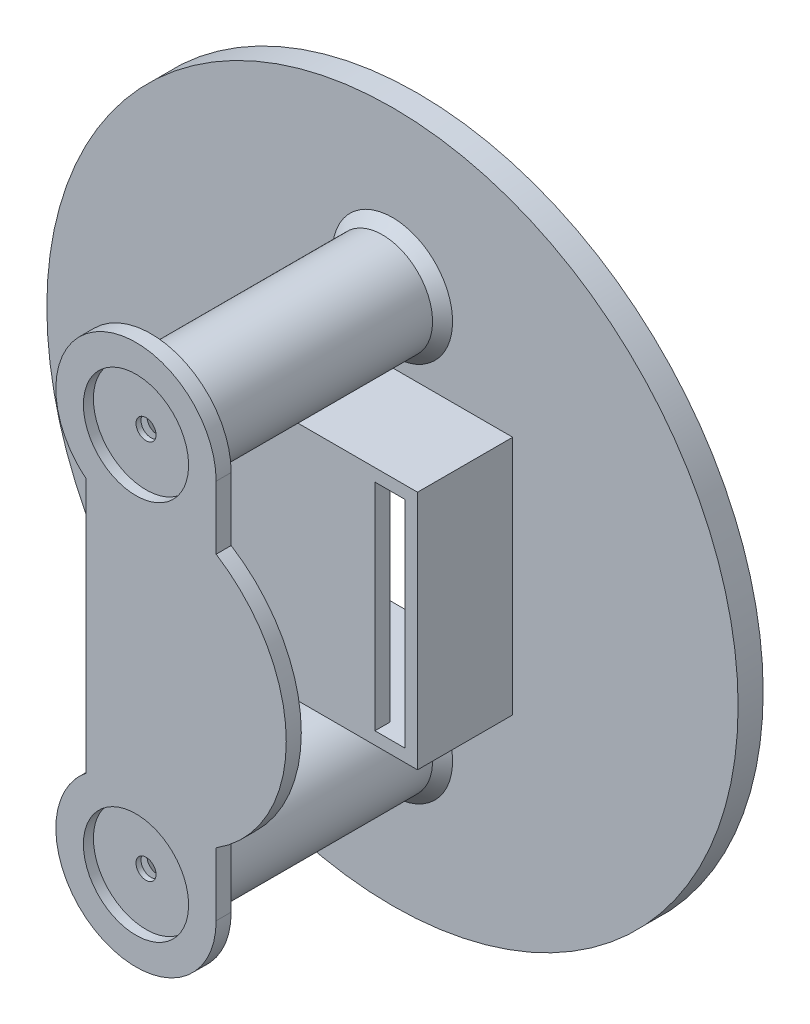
ISO-10303-21;
HEADER;
FILE_DESCRIPTION(('STEP AP214'),'2;1');
FILE_NAME('part.step','',(''),(''),'','','');
FILE_SCHEMA(('AUTOMOTIVE_DESIGN { 1 0 10303 214 1 1 1 1 }'));
ENDSEC;
DATA;
#1=APPLICATION_CONTEXT('core data for automotive mechanical design processes');
#2=APPLICATION_PROTOCOL_DEFINITION('international standard','automotive_design',2000,#1);
#3=PRODUCT_CONTEXT('',#1,'mechanical');
#4=PRODUCT('Part','Part','',(#3));
#5=PRODUCT_RELATED_PRODUCT_CATEGORY('part','',(#4));
#6=PRODUCT_DEFINITION_FORMATION('','',#4);
#7=PRODUCT_DEFINITION_CONTEXT('part definition',#1,'design');
#8=PRODUCT_DEFINITION('design','',#6,#7);
#9=PRODUCT_DEFINITION_SHAPE('','',#8);
#10=(LENGTH_UNIT() NAMED_UNIT(*) SI_UNIT(.MILLI.,.METRE.));
#11=(NAMED_UNIT(*) PLANE_ANGLE_UNIT() SI_UNIT($,.RADIAN.));
#12=(NAMED_UNIT(*) SI_UNIT($,.STERADIAN.) SOLID_ANGLE_UNIT());
#13=UNCERTAINTY_MEASURE_WITH_UNIT(LENGTH_MEASURE(1.E-05),#10,'distance_accuracy_value','');
#14=(GEOMETRIC_REPRESENTATION_CONTEXT(3) GLOBAL_UNCERTAINTY_ASSIGNED_CONTEXT((#13)) GLOBAL_UNIT_ASSIGNED_CONTEXT((#10,
#11,#12)) REPRESENTATION_CONTEXT('',''));
#15=CARTESIAN_POINT('',(0.,0.,0.));
#16=DIRECTION('',(0.,0.,1.));
#17=DIRECTION('',(1.,0.,0.));
#18=AXIS2_PLACEMENT_3D('',#15,#16,#17);
#19=CARTESIAN_POINT('',(0.,0.,0.));
#20=DIRECTION('',(0.,0.,1.));
#21=DIRECTION('',(1.,0.,0.));
#22=AXIS2_PLACEMENT_3D('',#19,#20,#21);
#23=CYLINDRICAL_SURFACE('',#22,34.5);
#24=CARTESIAN_POINT('',(0.,0.,2.5));
#25=DIRECTION('',(0.,0.,1.));
#26=DIRECTION('',(1.,0.,0.));
#27=AXIS2_PLACEMENT_3D('',#24,#25,#26);
#28=CIRCLE('',#27,34.5);
#29=CARTESIAN_POINT('',(-34.5,0.,2.5));
#30=VERTEX_POINT('',#29);
#31=EDGE_CURVE('P0_E218',#30,#30,#28,.T.);
#32=ORIENTED_EDGE('',*,*,#31,.F.);
#33=DIRECTION('',(0.,0.,-1.));
#34=VECTOR('',#33,1.);
#35=CARTESIAN_POINT('',(-34.5,0.,0.));
#36=LINE('',#35,#34);
#37=CARTESIAN_POINT('',(-34.5,0.,0.));
#38=VERTEX_POINT('',#37);
#39=EDGE_CURVE('P0_E11',#30,#38,#36,.T.);
#40=ORIENTED_EDGE('',*,*,#39,.T.);
#41=CARTESIAN_POINT('',(0.,0.,0.));
#42=DIRECTION('',(0.,0.,1.));
#43=DIRECTION('',(1.,0.,0.));
#44=AXIS2_PLACEMENT_3D('',#41,#42,#43);
#45=CIRCLE('',#44,34.5);
#46=EDGE_CURVE('P0_E284',#38,#38,#45,.T.);
#47=ORIENTED_EDGE('',*,*,#46,.T.);
#48=ORIENTED_EDGE('',*,*,#39,.F.);
#49=EDGE_LOOP('',(#32,#40,#47,#48));
#50=FACE_BOUND('',#49,.T.);
#51=ADVANCED_FACE('P0_F17',(#50),#23,.T.);
#52=CARTESIAN_POINT('',(0.,-19.,0.));
#53=DIRECTION('',(0.,0.,1.));
#54=DIRECTION('',(1.,0.,0.));
#55=AXIS2_PLACEMENT_3D('',#52,#53,#54);
#56=CYLINDRICAL_SURFACE('',#55,2.75);
#57=CARTESIAN_POINT('',(0.,-19.,24.5));
#58=DIRECTION('',(0.,0.,1.));
#59=DIRECTION('',(1.,0.,0.));
#60=AXIS2_PLACEMENT_3D('',#57,#58,#59);
#61=CIRCLE('',#60,2.75);
#62=CARTESIAN_POINT('',(-2.75,-19.,24.5));
#63=VERTEX_POINT('',#62);
#64=EDGE_CURVE('P0_E199',#63,#63,#61,.T.);
#65=ORIENTED_EDGE('',*,*,#64,.T.);
#66=DIRECTION('',(0.,0.,-1.));
#67=VECTOR('',#66,1.);
#68=CARTESIAN_POINT('',(-2.75,-19.,0.));
#69=LINE('',#68,#67);
#70=CARTESIAN_POINT('',(-2.75,-19.,0.));
#71=VERTEX_POINT('',#70);
#72=EDGE_CURVE('P0_E28',#63,#71,#69,.T.);
#73=ORIENTED_EDGE('',*,*,#72,.T.);
#74=CARTESIAN_POINT('',(0.,-19.,0.));
#75=DIRECTION('',(0.,0.,-1.));
#76=DIRECTION('',(1.,0.,0.));
#77=AXIS2_PLACEMENT_3D('',#74,#75,#76);
#78=CIRCLE('',#77,2.75);
#79=EDGE_CURVE('P0_E201',#71,#71,#78,.T.);
#80=ORIENTED_EDGE('',*,*,#79,.T.);
#81=ORIENTED_EDGE('',*,*,#72,.F.);
#82=EDGE_LOOP('',(#65,#73,#80,#81));
#83=FACE_BOUND('',#82,.T.);
#84=ADVANCED_FACE('P0_F197',(#83),#56,.F.);
#85=CARTESIAN_POINT('',(0.,19.0000002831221,0.));
#86=DIRECTION('',(0.,0.,1.));
#87=DIRECTION('',(1.,0.,0.));
#88=AXIS2_PLACEMENT_3D('',#85,#86,#87);
#89=CYLINDRICAL_SURFACE('',#88,2.75);
#90=CARTESIAN_POINT('',(0.,19.0000002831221,24.5));
#91=DIRECTION('',(0.,0.,1.));
#92=DIRECTION('',(1.,0.,0.));
#93=AXIS2_PLACEMENT_3D('',#90,#91,#92);
#94=CIRCLE('',#93,2.75);
#95=CARTESIAN_POINT('',(-2.75,19.0000002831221,24.5));
#96=VERTEX_POINT('',#95);
#97=EDGE_CURVE('P0_E240',#96,#96,#94,.T.);
#98=ORIENTED_EDGE('',*,*,#97,.T.);
#99=DIRECTION('',(0.,0.,-1.));
#100=VECTOR('',#99,1.);
#101=CARTESIAN_POINT('',(-2.75,19.0000002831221,0.));
#102=LINE('',#101,#100);
#103=CARTESIAN_POINT('',(-2.75,19.0000002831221,0.));
#104=VERTEX_POINT('',#103);
#105=EDGE_CURVE('P0_E144',#96,#104,#102,.T.);
#106=ORIENTED_EDGE('',*,*,#105,.T.);
#107=CARTESIAN_POINT('',(0.,19.0000002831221,0.));
#108=DIRECTION('',(0.,0.,-1.));
#109=DIRECTION('',(1.,0.,0.));
#110=AXIS2_PLACEMENT_3D('',#107,#108,#109);
#111=CIRCLE('',#110,2.75);
#112=EDGE_CURVE('P0_E21',#104,#104,#111,.T.);
#113=ORIENTED_EDGE('',*,*,#112,.T.);
#114=ORIENTED_EDGE('',*,*,#105,.F.);
#115=EDGE_LOOP('',(#98,#106,#113,#114));
#116=FACE_BOUND('',#115,.T.);
#117=ADVANCED_FACE('P0_F614',(#116),#89,.F.);
#118=CARTESIAN_POINT('',(0.,0.,12.));
#119=DIRECTION('',(0.,0.,1.));
#120=DIRECTION('',(1.,0.,0.));
#121=AXIS2_PLACEMENT_3D('',#118,#119,#120);
#122=PLANE('',#121);
#123=CARTESIAN_POINT('',(-8.1,8.1,12.));
#124=DIRECTION('',(0.,0.,-1.));
#125=DIRECTION('',(1.,0.,0.));
#126=AXIS2_PLACEMENT_3D('',#123,#124,#125);
#127=CIRCLE('',#126,1.65);
#128=CARTESIAN_POINT('',(-9.75,8.1,12.));
#129=VERTEX_POINT('',#128);
#130=EDGE_CURVE('P0_E317',#129,#129,#127,.T.);
#131=ORIENTED_EDGE('',*,*,#130,.T.);
#132=EDGE_LOOP('',(#131));
#133=FACE_BOUND('',#132,.T.);
#134=DIRECTION('',(0.,1.,0.));
#135=VECTOR('',#134,1.);
#136=CARTESIAN_POINT('',(7.75,10.75,12.));
#137=LINE('',#136,#135);
#138=CARTESIAN_POINT('',(7.75,-10.75,12.));
#139=VERTEX_POINT('',#138);
#140=CARTESIAN_POINT('',(7.75,10.75,12.));
#141=VERTEX_POINT('',#140);
#142=EDGE_CURVE('P0_E274',#139,#141,#137,.T.);
#143=ORIENTED_EDGE('',*,*,#142,.T.);
#144=DIRECTION('',(1.,0.,0.));
#145=VECTOR('',#144,1.);
#146=CARTESIAN_POINT('',(10.75,10.75,12.));
#147=LINE('',#146,#145);
#148=CARTESIAN_POINT('',(10.75,10.75,12.));
#149=VERTEX_POINT('',#148);
#150=EDGE_CURVE('P0_E275',#141,#149,#147,.T.);
#151=ORIENTED_EDGE('',*,*,#150,.T.);
#152=DIRECTION('',(0.,-1.,0.));
#153=VECTOR('',#152,1.);
#154=CARTESIAN_POINT('',(10.75,-10.75,12.));
#155=LINE('',#154,#153);
#156=CARTESIAN_POINT('',(10.75,-10.75,12.));
#157=VERTEX_POINT('',#156);
#158=EDGE_CURVE('P0_E331',#149,#157,#155,.T.);
#159=ORIENTED_EDGE('',*,*,#158,.T.);
#160=DIRECTION('',(-1.,0.,0.));
#161=VECTOR('',#160,1.);
#162=CARTESIAN_POINT('',(-10.75,-10.75,12.));
#163=LINE('',#162,#161);
#164=EDGE_CURVE('P0_E320',#157,#139,#163,.T.);
#165=ORIENTED_EDGE('',*,*,#164,.T.);
#166=EDGE_LOOP('',(#143,#151,#159,#165));
#167=FACE_BOUND('',#166,.T.);
#168=DIRECTION('',(0.,1.,0.));
#169=VECTOR('',#168,1.);
#170=CARTESIAN_POINT('',(12.0000001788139,-12.0000001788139,12.));
#171=LINE('',#170,#169);
#172=CARTESIAN_POINT('',(12.0000001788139,-12.0000001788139,12.));
#173=VERTEX_POINT('',#172);
#174=CARTESIAN_POINT('',(12.0000001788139,12.0000001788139,12.));
#175=VERTEX_POINT('',#174);
#176=EDGE_CURVE('P0_E315',#173,#175,#171,.T.);
#177=ORIENTED_EDGE('',*,*,#176,.T.);
#178=DIRECTION('',(-1.,0.,0.));
#179=VECTOR('',#178,1.);
#180=CARTESIAN_POINT('',(12.0000001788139,12.0000001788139,12.));
#181=LINE('',#180,#179);
#182=CARTESIAN_POINT('',(-12.0000001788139,12.0000001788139,12.));
#183=VERTEX_POINT('',#182);
#184=EDGE_CURVE('P0_E42',#175,#183,#181,.T.);
#185=ORIENTED_EDGE('',*,*,#184,.T.);
#186=DIRECTION('',(0.,-1.,0.));
#187=VECTOR('',#186,1.);
#188=CARTESIAN_POINT('',(-12.0000001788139,12.0000001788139,12.));
#189=LINE('',#188,#187);
#190=CARTESIAN_POINT('',(-12.0000001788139,-12.0000001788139,12.));
#191=VERTEX_POINT('',#190);
#192=EDGE_CURVE('P0_E279',#183,#191,#189,.T.);
#193=ORIENTED_EDGE('',*,*,#192,.T.);
#194=DIRECTION('',(1.,0.,0.));
#195=VECTOR('',#194,1.);
#196=CARTESIAN_POINT('',(-12.0000001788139,-12.0000001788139,12.));
#197=LINE('',#196,#195);
#198=EDGE_CURVE('P0_E290',#191,#173,#197,.T.);
#199=ORIENTED_EDGE('',*,*,#198,.T.);
#200=EDGE_LOOP('',(#177,#185,#193,#199));
#201=FACE_BOUND('',#200,.T.);
#202=ADVANCED_FACE('P0_F387',(#133,#167,#201),#122,.T.);
#203=CARTESIAN_POINT('',(12.0000001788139,12.0000001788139,0.));
#204=DIRECTION('',(0.,1.,0.));
#205=DIRECTION('',(1.,0.,0.));
#206=AXIS2_PLACEMENT_3D('',#203,#204,#205);
#207=PLANE('',#206);
#208=DIRECTION('',(1.,0.,0.));
#209=VECTOR('',#208,1.);
#210=CARTESIAN_POINT('',(12.0000001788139,12.0000001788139,2.5));
#211=LINE('',#210,#209);
#212=CARTESIAN_POINT('',(-12.0000001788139,12.0000001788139,2.5));
#213=VERTEX_POINT('',#212);
#214=CARTESIAN_POINT('',(12.0000001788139,12.0000001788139,2.5));
#215=VERTEX_POINT('',#214);
#216=EDGE_CURVE('P0_E295',#213,#215,#211,.T.);
#217=ORIENTED_EDGE('',*,*,#216,.F.);
#218=DIRECTION('',(0.,0.,1.));
#219=VECTOR('',#218,1.);
#220=CARTESIAN_POINT('',(-12.0000001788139,12.0000001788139,0.));
#221=LINE('',#220,#219);
#222=EDGE_CURVE('P0_E276',#213,#183,#221,.T.);
#223=ORIENTED_EDGE('',*,*,#222,.T.);
#224=ORIENTED_EDGE('',*,*,#184,.F.);
#225=DIRECTION('',(0.,0.,1.));
#226=VECTOR('',#225,1.);
#227=CARTESIAN_POINT('',(12.0000001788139,12.0000001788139,0.));
#228=LINE('',#227,#226);
#229=EDGE_CURVE('P0_E318',#215,#175,#228,.T.);
#230=ORIENTED_EDGE('',*,*,#229,.F.);
#231=EDGE_LOOP('',(#217,#223,#224,#230));
#232=FACE_BOUND('',#231,.T.);
#233=ADVANCED_FACE('P0_F19',(#232),#207,.T.);
#234=CARTESIAN_POINT('',(-12.0000001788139,12.0000001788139,0.));
#235=DIRECTION('',(-1.,0.,0.));
#236=DIRECTION('',(0.,0.,1.));
#237=AXIS2_PLACEMENT_3D('',#234,#235,#236);
#238=PLANE('',#237);
#239=DIRECTION('',(0.,1.,0.));
#240=VECTOR('',#239,1.);
#241=CARTESIAN_POINT('',(-12.0000001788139,12.0000001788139,2.5));
#242=LINE('',#241,#240);
#243=CARTESIAN_POINT('',(-12.0000001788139,-12.0000001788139,2.5));
#244=VERTEX_POINT('',#243);
#245=EDGE_CURVE('P0_E256',#244,#213,#242,.T.);
#246=ORIENTED_EDGE('',*,*,#245,.F.);
#247=DIRECTION('',(0.,0.,1.));
#248=VECTOR('',#247,1.);
#249=CARTESIAN_POINT('',(-12.0000001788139,-12.0000001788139,0.));
#250=LINE('',#249,#248);
#251=EDGE_CURVE('P0_E314',#244,#191,#250,.T.);
#252=ORIENTED_EDGE('',*,*,#251,.T.);
#253=ORIENTED_EDGE('',*,*,#192,.F.);
#254=ORIENTED_EDGE('',*,*,#222,.F.);
#255=EDGE_LOOP('',(#246,#252,#253,#254));
#256=FACE_BOUND('',#255,.T.);
#257=ADVANCED_FACE('P0_F391',(#256),#238,.T.);
#258=CARTESIAN_POINT('',(7.75,-10.75,0.));
#259=DIRECTION('',(1.,0.,0.));
#260=DIRECTION('',(0.,1.,0.));
#261=AXIS2_PLACEMENT_3D('',#258,#259,#260);
#262=PLANE('',#261);
#263=DIRECTION('',(0.,1.,0.));
#264=VECTOR('',#263,1.);
#265=CARTESIAN_POINT('',(7.75,-5.375,10.5));
#266=LINE('',#265,#264);
#267=CARTESIAN_POINT('',(7.75,-10.75,10.5));
#268=VERTEX_POINT('',#267);
#269=CARTESIAN_POINT('',(7.75,10.75,10.5));
#270=VERTEX_POINT('',#269);
#271=EDGE_CURVE('P0_E285',#268,#270,#266,.T.);
#272=ORIENTED_EDGE('',*,*,#271,.T.);
#273=DIRECTION('',(0.,0.,1.));
#274=VECTOR('',#273,1.);
#275=CARTESIAN_POINT('',(7.75,10.75,0.));
#276=LINE('',#275,#274);
#277=EDGE_CURVE('P0_E270',#270,#141,#276,.T.);
#278=ORIENTED_EDGE('',*,*,#277,.T.);
#279=ORIENTED_EDGE('',*,*,#142,.F.);
#280=DIRECTION('',(0.,0.,1.));
#281=VECTOR('',#280,1.);
#282=CARTESIAN_POINT('',(7.75,-10.75,0.));
#283=LINE('',#282,#281);
#284=EDGE_CURVE('P0_E325',#268,#139,#283,.T.);
#285=ORIENTED_EDGE('',*,*,#284,.F.);
#286=EDGE_LOOP('',(#272,#278,#279,#285));
#287=FACE_BOUND('',#286,.T.);
#288=ADVANCED_FACE('P0_F448',(#287),#262,.T.);
#289=CARTESIAN_POINT('',(7.75,10.75,0.));
#290=DIRECTION('',(0.,-1.,0.));
#291=DIRECTION('',(0.,0.,-1.));
#292=AXIS2_PLACEMENT_3D('',#289,#290,#291);
#293=PLANE('',#292);
#294=DIRECTION('',(-1.,0.,0.));
#295=VECTOR('',#294,1.);
#296=CARTESIAN_POINT('',(3.875,10.75,0.));
#297=LINE('',#296,#295);
#298=CARTESIAN_POINT('',(10.75,10.75,0.));
#299=VERTEX_POINT('',#298);
#300=CARTESIAN_POINT('',(-10.75,10.75,0.));
#301=VERTEX_POINT('',#300);
#302=EDGE_CURVE('P0_E248',#299,#301,#297,.T.);
#303=ORIENTED_EDGE('',*,*,#302,.F.);
#304=DIRECTION('',(0.,0.,1.));
#305=VECTOR('',#304,1.);
#306=CARTESIAN_POINT('',(10.75,10.75,0.));
#307=LINE('',#306,#305);
#308=EDGE_CURVE('P0_E155',#299,#149,#307,.T.);
#309=ORIENTED_EDGE('',*,*,#308,.T.);
#310=ORIENTED_EDGE('',*,*,#150,.F.);
#311=ORIENTED_EDGE('',*,*,#277,.F.);
#312=DIRECTION('',(-1.,0.,0.));
#313=VECTOR('',#312,1.);
#314=CARTESIAN_POINT('',(10.75,10.75,10.5));
#315=LINE('',#314,#313);
#316=CARTESIAN_POINT('',(-10.75,10.75,10.5));
#317=VERTEX_POINT('',#316);
#318=EDGE_CURVE('P0_E421',#270,#317,#315,.T.);
#319=ORIENTED_EDGE('',*,*,#318,.T.);
#320=DIRECTION('',(0.,0.,1.));
#321=VECTOR('',#320,1.);
#322=CARTESIAN_POINT('',(-10.75,10.75,0.));
#323=LINE('',#322,#321);
#324=EDGE_CURVE('P0_E230',#301,#317,#323,.T.);
#325=ORIENTED_EDGE('',*,*,#324,.F.);
#326=EDGE_LOOP('',(#303,#309,#310,#311,#319,#325));
#327=FACE_BOUND('',#326,.T.);
#328=ADVANCED_FACE('P0_F454',(#327),#293,.T.);
#329=CARTESIAN_POINT('',(10.75,10.75,0.));
#330=DIRECTION('',(-1.,0.,0.));
#331=DIRECTION('',(0.,0.,1.));
#332=AXIS2_PLACEMENT_3D('',#329,#330,#331);
#333=PLANE('',#332);
#334=DIRECTION('',(0.,-1.,0.));
#335=VECTOR('',#334,1.);
#336=CARTESIAN_POINT('',(10.75,-10.75,0.));
#337=LINE('',#336,#335);
#338=CARTESIAN_POINT('',(10.75,-10.75,0.));
#339=VERTEX_POINT('',#338);
#340=EDGE_CURVE('P0_E291',#299,#339,#337,.T.);
#341=ORIENTED_EDGE('',*,*,#340,.T.);
#342=DIRECTION('',(0.,0.,1.));
#343=VECTOR('',#342,1.);
#344=CARTESIAN_POINT('',(10.75,-10.75,0.));
#345=LINE('',#344,#343);
#346=EDGE_CURVE('P0_E324',#339,#157,#345,.T.);
#347=ORIENTED_EDGE('',*,*,#346,.T.);
#348=ORIENTED_EDGE('',*,*,#158,.F.);
#349=ORIENTED_EDGE('',*,*,#308,.F.);
#350=EDGE_LOOP('',(#341,#347,#348,#349));
#351=FACE_BOUND('',#350,.T.);
#352=ADVANCED_FACE('P0_F440',(#351),#333,.T.);
#353=CARTESIAN_POINT('',(10.75,-10.75,0.));
#354=DIRECTION('',(0.,1.,0.));
#355=DIRECTION('',(1.,0.,0.));
#356=AXIS2_PLACEMENT_3D('',#353,#354,#355);
#357=PLANE('',#356);
#358=DIRECTION('',(1.,0.,0.));
#359=VECTOR('',#358,1.);
#360=CARTESIAN_POINT('',(-5.375,-10.75,0.));
#361=LINE('',#360,#359);
#362=CARTESIAN_POINT('',(-10.75,-10.75,0.));
#363=VERTEX_POINT('',#362);
#364=EDGE_CURVE('P0_E251',#363,#339,#361,.T.);
#365=ORIENTED_EDGE('',*,*,#364,.F.);
#366=DIRECTION('',(0.,0.,1.));
#367=VECTOR('',#366,1.);
#368=CARTESIAN_POINT('',(-10.75,-10.75,0.));
#369=LINE('',#368,#367);
#370=CARTESIAN_POINT('',(-10.75,-10.75,10.5));
#371=VERTEX_POINT('',#370);
#372=EDGE_CURVE('P0_E211',#363,#371,#369,.T.);
#373=ORIENTED_EDGE('',*,*,#372,.T.);
#374=DIRECTION('',(1.,0.,0.));
#375=VECTOR('',#374,1.);
#376=CARTESIAN_POINT('',(-10.75,-10.75,10.5));
#377=LINE('',#376,#375);
#378=EDGE_CURVE('P0_E408',#371,#268,#377,.T.);
#379=ORIENTED_EDGE('',*,*,#378,.T.);
#380=ORIENTED_EDGE('',*,*,#284,.T.);
#381=ORIENTED_EDGE('',*,*,#164,.F.);
#382=ORIENTED_EDGE('',*,*,#346,.F.);
#383=EDGE_LOOP('',(#365,#373,#379,#380,#381,#382));
#384=FACE_BOUND('',#383,.T.);
#385=ADVANCED_FACE('P0_F442',(#384),#357,.T.);
#386=CARTESIAN_POINT('',(-8.1,8.1,0.));
#387=DIRECTION('',(0.,0.,1.));
#388=DIRECTION('',(1.,0.,0.));
#389=AXIS2_PLACEMENT_3D('',#386,#387,#388);
#390=CYLINDRICAL_SURFACE('',#389,1.65);
#391=ORIENTED_EDGE('',*,*,#130,.F.);
#392=DIRECTION('',(0.,0.,-1.));
#393=VECTOR('',#392,1.);
#394=CARTESIAN_POINT('',(-9.75,8.1,0.));
#395=LINE('',#394,#393);
#396=CARTESIAN_POINT('',(-9.75,8.1,10.5));
#397=VERTEX_POINT('',#396);
#398=EDGE_CURVE('P0_E341',#129,#397,#395,.T.);
#399=ORIENTED_EDGE('',*,*,#398,.T.);
#400=CARTESIAN_POINT('',(-8.1,8.1,10.5));
#401=DIRECTION('',(0.,0.,-1.));
#402=DIRECTION('',(1.,0.,0.));
#403=AXIS2_PLACEMENT_3D('',#400,#401,#402);
#404=CIRCLE('',#403,1.65);
#405=EDGE_CURVE('P0_E280',#397,#397,#404,.T.);
#406=ORIENTED_EDGE('',*,*,#405,.T.);
#407=ORIENTED_EDGE('',*,*,#398,.F.);
#408=EDGE_LOOP('',(#391,#399,#406,#407));
#409=FACE_BOUND('',#408,.T.);
#410=ADVANCED_FACE('P0_F710',(#409),#390,.F.);
#411=CARTESIAN_POINT('',(12.0000001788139,-12.0000001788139,0.));
#412=DIRECTION('',(1.,0.,0.));
#413=DIRECTION('',(0.,1.,0.));
#414=AXIS2_PLACEMENT_3D('',#411,#412,#413);
#415=PLANE('',#414);
#416=DIRECTION('',(0.,-1.,0.));
#417=VECTOR('',#416,1.);
#418=CARTESIAN_POINT('',(12.0000001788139,-12.0000001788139,2.5));
#419=LINE('',#418,#417);
#420=CARTESIAN_POINT('',(12.0000001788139,-12.0000001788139,2.5));
#421=VERTEX_POINT('',#420);
#422=EDGE_CURVE('P0_E239',#215,#421,#419,.T.);
#423=ORIENTED_EDGE('',*,*,#422,.F.);
#424=ORIENTED_EDGE('',*,*,#229,.T.);
#425=ORIENTED_EDGE('',*,*,#176,.F.);
#426=DIRECTION('',(0.,0.,1.));
#427=VECTOR('',#426,1.);
#428=CARTESIAN_POINT('',(12.0000001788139,-12.0000001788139,0.));
#429=LINE('',#428,#427);
#430=EDGE_CURVE('P0_E286',#421,#173,#429,.T.);
#431=ORIENTED_EDGE('',*,*,#430,.F.);
#432=EDGE_LOOP('',(#423,#424,#425,#431));
#433=FACE_BOUND('',#432,.T.);
#434=ADVANCED_FACE('P0_F398',(#433),#415,.T.);
#435=CARTESIAN_POINT('',(-12.0000001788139,-12.0000001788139,0.));
#436=DIRECTION('',(0.,-1.,0.));
#437=DIRECTION('',(0.,0.,-1.));
#438=AXIS2_PLACEMENT_3D('',#435,#436,#437);
#439=PLANE('',#438);
#440=DIRECTION('',(-1.,0.,0.));
#441=VECTOR('',#440,1.);
#442=CARTESIAN_POINT('',(-12.0000001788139,-12.0000001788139,2.5));
#443=LINE('',#442,#441);
#444=EDGE_CURVE('P0_E252',#421,#244,#443,.T.);
#445=ORIENTED_EDGE('',*,*,#444,.F.);
#446=ORIENTED_EDGE('',*,*,#430,.T.);
#447=ORIENTED_EDGE('',*,*,#198,.F.);
#448=ORIENTED_EDGE('',*,*,#251,.F.);
#449=EDGE_LOOP('',(#445,#446,#447,#448));
#450=FACE_BOUND('',#449,.T.);
#451=ADVANCED_FACE('P0_F394',(#450),#439,.T.);
#452=CARTESIAN_POINT('',(0.,0.,0.));
#453=DIRECTION('',(0.,0.,1.));
#454=DIRECTION('',(1.,0.,0.));
#455=AXIS2_PLACEMENT_3D('',#452,#453,#454);
#456=PLANE('',#455);
#457=ORIENTED_EDGE('',*,*,#302,.T.);
#458=DIRECTION('',(0.,-1.,0.));
#459=VECTOR('',#458,1.);
#460=CARTESIAN_POINT('',(-10.75,5.375,0.));
#461=LINE('',#460,#459);
#462=EDGE_CURVE('P0_E235',#301,#363,#461,.T.);
#463=ORIENTED_EDGE('',*,*,#462,.T.);
#464=ORIENTED_EDGE('',*,*,#364,.T.);
#465=ORIENTED_EDGE('',*,*,#340,.F.);
#466=EDGE_LOOP('',(#457,#463,#464,#465));
#467=FACE_BOUND('',#466,.T.);
#468=ORIENTED_EDGE('',*,*,#112,.F.);
#469=EDGE_LOOP('',(#468));
#470=FACE_BOUND('',#469,.T.);
#471=ORIENTED_EDGE('',*,*,#79,.F.);
#472=EDGE_LOOP('',(#471));
#473=FACE_BOUND('',#472,.T.);
#474=ORIENTED_EDGE('',*,*,#46,.F.);
#475=EDGE_LOOP('',(#474));
#476=FACE_BOUND('',#475,.T.);
#477=ADVANCED_FACE('P0_F460',(#467,#470,#473,#476),#456,.F.);
#478=CARTESIAN_POINT('',(-1.5,0.,10.5));
#479=DIRECTION('',(0.,0.,1.));
#480=DIRECTION('',(1.,0.,0.));
#481=AXIS2_PLACEMENT_3D('',#478,#479,#480);
#482=PLANE('',#481);
#483=ORIENTED_EDGE('',*,*,#405,.F.);
#484=EDGE_LOOP('',(#483));
#485=FACE_BOUND('',#484,.T.);
#486=ORIENTED_EDGE('',*,*,#378,.F.);
#487=DIRECTION('',(0.,-1.,0.));
#488=VECTOR('',#487,1.);
#489=CARTESIAN_POINT('',(-10.75,10.75,10.5));
#490=LINE('',#489,#488);
#491=EDGE_CURVE('P0_E234',#317,#371,#490,.T.);
#492=ORIENTED_EDGE('',*,*,#491,.F.);
#493=ORIENTED_EDGE('',*,*,#318,.F.);
#494=ORIENTED_EDGE('',*,*,#271,.F.);
#495=EDGE_LOOP('',(#486,#492,#493,#494));
#496=FACE_BOUND('',#495,.T.);
#497=ADVANCED_FACE('P0_F451',(#485,#496),#482,.F.);
#498=CARTESIAN_POINT('',(-10.75,10.75,0.));
#499=DIRECTION('',(-1.,0.,0.));
#500=DIRECTION('',(0.,0.,1.));
#501=AXIS2_PLACEMENT_3D('',#498,#499,#500);
#502=PLANE('',#501);
#503=ORIENTED_EDGE('',*,*,#462,.F.);
#504=ORIENTED_EDGE('',*,*,#324,.T.);
#505=ORIENTED_EDGE('',*,*,#491,.T.);
#506=ORIENTED_EDGE('',*,*,#372,.F.);
#507=EDGE_LOOP('',(#503,#504,#505,#506));
#508=FACE_BOUND('',#507,.T.);
#509=ADVANCED_FACE('P0_F458',(#508),#502,.F.);
#510=CARTESIAN_POINT('',(0.,-19.,24.5));
#511=DIRECTION('',(0.,0.,1.));
#512=DIRECTION('',(1.,0.,0.));
#513=AXIS2_PLACEMENT_3D('',#510,#511,#512);
#514=PLANE('',#513);
#515=CARTESIAN_POINT('',(0.,-19.,24.5));
#516=DIRECTION('',(0.,0.,-1.));
#517=DIRECTION('',(-1.,0.,0.));
#518=AXIS2_PLACEMENT_3D('',#515,#516,#517);
#519=CIRCLE('',#518,2.50000029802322);
#520=CARTESIAN_POINT('',(2.50000029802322,-19.,24.5));
#521=VERTEX_POINT('',#520);
#522=EDGE_CURVE('P0_E243',#521,#521,#519,.T.);
#523=ORIENTED_EDGE('',*,*,#522,.F.);
#524=EDGE_LOOP('',(#523));
#525=FACE_BOUND('',#524,.T.);
#526=ORIENTED_EDGE('',*,*,#64,.F.);
#527=EDGE_LOOP('',(#526));
#528=FACE_BOUND('',#527,.T.);
#529=ADVANCED_FACE('P0_F642',(#525,#528),#514,.F.);
#530=CARTESIAN_POINT('',(0.,-19.,25.25));
#531=DIRECTION('',(0.,0.,-1.));
#532=DIRECTION('',(-1.,0.,0.));
#533=AXIS2_PLACEMENT_3D('',#530,#531,#532);
#534=CONICAL_SURFACE('',#533,1.75000029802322,0.785398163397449);
#535=ORIENTED_EDGE('',*,*,#522,.T.);
#536=DIRECTION('',(-0.707106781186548,0.,0.707106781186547));
#537=VECTOR('',#536,1.);
#538=CARTESIAN_POINT('',(1.75000029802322,-19.,25.25));
#539=LINE('',#538,#537);
#540=CARTESIAN_POINT('',(1.00000029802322,-19.,26.));
#541=VERTEX_POINT('',#540);
#542=EDGE_CURVE('P0_E412',#521,#541,#539,.T.);
#543=ORIENTED_EDGE('',*,*,#542,.T.);
#544=CARTESIAN_POINT('',(0.,-19.,26.));
#545=DIRECTION('',(0.,0.,1.));
#546=DIRECTION('',(-1.,0.,0.));
#547=AXIS2_PLACEMENT_3D('',#544,#545,#546);
#548=CIRCLE('',#547,1.00000029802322);
#549=EDGE_CURVE('P0_E224',#541,#541,#548,.T.);
#550=ORIENTED_EDGE('',*,*,#549,.T.);
#551=ORIENTED_EDGE('',*,*,#542,.F.);
#552=EDGE_LOOP('',(#535,#543,#550,#551));
#553=FACE_BOUND('',#552,.T.);
#554=ADVANCED_FACE('P0_F644',(#553),#534,.F.);
#555=CARTESIAN_POINT('',(0.,19.0000002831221,24.5));
#556=DIRECTION('',(0.,0.,1.));
#557=DIRECTION('',(1.,0.,0.));
#558=AXIS2_PLACEMENT_3D('',#555,#556,#557);
#559=PLANE('',#558);
#560=CARTESIAN_POINT('',(0.,19.0000002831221,24.5));
#561=DIRECTION('',(0.,0.,-1.));
#562=DIRECTION('',(-1.,0.,0.));
#563=AXIS2_PLACEMENT_3D('',#560,#561,#562);
#564=CIRCLE('',#563,2.5);
#565=CARTESIAN_POINT('',(2.5,19.0000002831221,24.5));
#566=VERTEX_POINT('',#565);
#567=EDGE_CURVE('P0_E261',#566,#566,#564,.T.);
#568=ORIENTED_EDGE('',*,*,#567,.F.);
#569=EDGE_LOOP('',(#568));
#570=FACE_BOUND('',#569,.T.);
#571=ORIENTED_EDGE('',*,*,#97,.F.);
#572=EDGE_LOOP('',(#571));
#573=FACE_BOUND('',#572,.T.);
#574=ADVANCED_FACE('P0_F641',(#570,#573),#559,.F.);
#575=CARTESIAN_POINT('',(0.,19.0000002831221,25.25));
#576=DIRECTION('',(0.,0.,-1.));
#577=DIRECTION('',(-1.,0.,0.));
#578=AXIS2_PLACEMENT_3D('',#575,#576,#577);
#579=CONICAL_SURFACE('',#578,1.75,0.785398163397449);
#580=ORIENTED_EDGE('',*,*,#567,.T.);
#581=DIRECTION('',(-0.707106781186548,0.,0.707106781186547));
#582=VECTOR('',#581,1.);
#583=CARTESIAN_POINT('',(1.75,19.0000002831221,25.25));
#584=LINE('',#583,#582);
#585=CARTESIAN_POINT('',(1.,19.0000002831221,26.));
#586=VERTEX_POINT('',#585);
#587=EDGE_CURVE('P0_E244',#566,#586,#584,.T.);
#588=ORIENTED_EDGE('',*,*,#587,.T.);
#589=CARTESIAN_POINT('',(0.,19.0000002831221,26.));
#590=DIRECTION('',(0.,0.,1.));
#591=DIRECTION('',(-1.,0.,0.));
#592=AXIS2_PLACEMENT_3D('',#589,#590,#591);
#593=CIRCLE('',#592,1.);
#594=EDGE_CURVE('P0_E217',#586,#586,#593,.T.);
#595=ORIENTED_EDGE('',*,*,#594,.T.);
#596=ORIENTED_EDGE('',*,*,#587,.F.);
#597=EDGE_LOOP('',(#580,#588,#595,#596));
#598=FACE_BOUND('',#597,.T.);
#599=ADVANCED_FACE('P0_F637',(#598),#579,.F.);
#600=CARTESIAN_POINT('',(0.,19.0000002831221,0.));
#601=DIRECTION('',(0.,0.,1.));
#602=DIRECTION('',(1.,0.,0.));
#603=AXIS2_PLACEMENT_3D('',#600,#601,#602);
#604=CYLINDRICAL_SURFACE('',#603,5.);
#605=CARTESIAN_POINT('',(0.,19.0000002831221,26.));
#606=DIRECTION('',(0.,0.,-1.));
#607=DIRECTION('',(1.,0.,0.));
#608=AXIS2_PLACEMENT_3D('',#605,#606,#607);
#609=CIRCLE('',#608,5.);
#610=CARTESIAN_POINT('',(-5.,19.0000002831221,26.));
#611=VERTEX_POINT('',#610);
#612=EDGE_CURVE('P0_E213',#611,#611,#609,.T.);
#613=ORIENTED_EDGE('',*,*,#612,.T.);
#614=DIRECTION('',(0.,0.,-1.));
#615=VECTOR('',#614,1.);
#616=CARTESIAN_POINT('',(-5.,19.0000002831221,0.));
#617=LINE('',#616,#615);
#618=CARTESIAN_POINT('',(-5.,19.0000002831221,3.5));
#619=VERTEX_POINT('',#618);
#620=EDGE_CURVE('P0_E357',#611,#619,#617,.T.);
#621=ORIENTED_EDGE('',*,*,#620,.T.);
#622=CARTESIAN_POINT('',(0.,19.0000002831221,3.5));
#623=DIRECTION('',(0.,0.,-1.));
#624=DIRECTION('',(1.,0.,0.));
#625=AXIS2_PLACEMENT_3D('',#622,#623,#624);
#626=CIRCLE('',#625,5.);
#627=EDGE_CURVE('P0_E335',#619,#619,#626,.T.);
#628=ORIENTED_EDGE('',*,*,#627,.F.);
#629=ORIENTED_EDGE('',*,*,#620,.F.);
#630=EDGE_LOOP('',(#613,#621,#628,#629));
#631=FACE_BOUND('',#630,.T.);
#632=ADVANCED_FACE('P0_F640',(#631),#604,.T.);
#633=CARTESIAN_POINT('',(0.,19.0000002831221,3.));
#634=DIRECTION('',(0.,0.,-1.));
#635=DIRECTION('',(1.,0.,0.));
#636=AXIS2_PLACEMENT_3D('',#633,#634,#635);
#637=CONICAL_SURFACE('',#636,5.5,0.785398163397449);
#638=CARTESIAN_POINT('',(0.,19.0000002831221,2.5));
#639=DIRECTION('',(0.,0.,1.));
#640=DIRECTION('',(1.,0.,0.));
#641=AXIS2_PLACEMENT_3D('',#638,#639,#640);
#642=CIRCLE('',#641,6.);
#643=CARTESIAN_POINT('',(-6.,19.0000002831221,2.5));
#644=VERTEX_POINT('',#643);
#645=EDGE_CURVE('P0_E222',#644,#644,#642,.T.);
#646=ORIENTED_EDGE('',*,*,#645,.T.);
#647=DIRECTION('',(0.707106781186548,0.,0.707106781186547));
#648=VECTOR('',#647,1.);
#649=CARTESIAN_POINT('',(-5.5,19.0000002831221,3.));
#650=LINE('',#649,#648);
#651=EDGE_CURVE('P0_E302',#644,#619,#650,.T.);
#652=ORIENTED_EDGE('',*,*,#651,.T.);
#653=ORIENTED_EDGE('',*,*,#627,.T.);
#654=ORIENTED_EDGE('',*,*,#651,.F.);
#655=EDGE_LOOP('',(#646,#652,#653,#654));
#656=FACE_BOUND('',#655,.T.);
#657=ADVANCED_FACE('P0_F706',(#656),#637,.T.);
#658=CARTESIAN_POINT('',(0.,-19.,0.));
#659=DIRECTION('',(0.,0.,1.));
#660=DIRECTION('',(1.,0.,0.));
#661=AXIS2_PLACEMENT_3D('',#658,#659,#660);
#662=CYLINDRICAL_SURFACE('',#661,5.);
#663=CARTESIAN_POINT('',(0.,-19.,26.));
#664=DIRECTION('',(0.,0.,-1.));
#665=DIRECTION('',(1.,0.,0.));
#666=AXIS2_PLACEMENT_3D('',#663,#664,#665);
#667=CIRCLE('',#666,5.);
#668=CARTESIAN_POINT('',(-5.,-19.,26.));
#669=VERTEX_POINT('',#668);
#670=EDGE_CURVE('P0_E229',#669,#669,#667,.T.);
#671=ORIENTED_EDGE('',*,*,#670,.T.);
#672=DIRECTION('',(0.,0.,-1.));
#673=VECTOR('',#672,1.);
#674=CARTESIAN_POINT('',(-5.,-19.,0.));
#675=LINE('',#674,#673);
#676=CARTESIAN_POINT('',(-5.,-19.,3.5));
#677=VERTEX_POINT('',#676);
#678=EDGE_CURVE('P0_E299',#669,#677,#675,.T.);
#679=ORIENTED_EDGE('',*,*,#678,.T.);
#680=CARTESIAN_POINT('',(0.,-19.,3.5));
#681=DIRECTION('',(0.,0.,-1.));
#682=DIRECTION('',(1.,0.,0.));
#683=AXIS2_PLACEMENT_3D('',#680,#681,#682);
#684=CIRCLE('',#683,5.);
#685=EDGE_CURVE('P0_E223',#677,#677,#684,.T.);
#686=ORIENTED_EDGE('',*,*,#685,.F.);
#687=ORIENTED_EDGE('',*,*,#678,.F.);
#688=EDGE_LOOP('',(#671,#679,#686,#687));
#689=FACE_BOUND('',#688,.T.);
#690=ADVANCED_FACE('P0_F659',(#689),#662,.T.);
#691=CARTESIAN_POINT('',(0.,0.,2.5));
#692=DIRECTION('',(0.,0.,1.));
#693=DIRECTION('',(1.,0.,0.));
#694=AXIS2_PLACEMENT_3D('',#691,#692,#693);
#695=PLANE('',#694);
#696=CARTESIAN_POINT('',(0.,-19.,2.5));
#697=DIRECTION('',(0.,0.,1.));
#698=DIRECTION('',(1.,0.,0.));
#699=AXIS2_PLACEMENT_3D('',#696,#697,#698);
#700=CIRCLE('',#699,6.);
#701=CARTESIAN_POINT('',(-6.,-19.,2.5));
#702=VERTEX_POINT('',#701);
#703=EDGE_CURVE('P0_E228',#702,#702,#700,.T.);
#704=ORIENTED_EDGE('',*,*,#703,.F.);
#705=EDGE_LOOP('',(#704));
#706=FACE_BOUND('',#705,.T.);
#707=ORIENTED_EDGE('',*,*,#422,.T.);
#708=ORIENTED_EDGE('',*,*,#444,.T.);
#709=ORIENTED_EDGE('',*,*,#245,.T.);
#710=ORIENTED_EDGE('',*,*,#216,.T.);
#711=EDGE_LOOP('',(#707,#708,#709,#710));
#712=FACE_BOUND('',#711,.T.);
#713=ORIENTED_EDGE('',*,*,#645,.F.);
#714=EDGE_LOOP('',(#713));
#715=FACE_BOUND('',#714,.T.);
#716=ORIENTED_EDGE('',*,*,#31,.T.);
#717=EDGE_LOOP('',(#716));
#718=FACE_BOUND('',#717,.T.);
#719=ADVANCED_FACE('P0_F605',(#706,#712,#715,#718),#695,.T.);
#720=CARTESIAN_POINT('',(0.,-19.,3.));
#721=DIRECTION('',(0.,0.,-1.));
#722=DIRECTION('',(1.,0.,0.));
#723=AXIS2_PLACEMENT_3D('',#720,#721,#722);
#724=CONICAL_SURFACE('',#723,5.5,0.785398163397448);
#725=ORIENTED_EDGE('',*,*,#703,.T.);
#726=DIRECTION('',(0.707106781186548,0.,0.707106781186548));
#727=VECTOR('',#726,1.);
#728=CARTESIAN_POINT('',(-5.5,-19.,3.));
#729=LINE('',#728,#727);
#730=EDGE_CURVE('P0_E269',#702,#677,#729,.T.);
#731=ORIENTED_EDGE('',*,*,#730,.T.);
#732=ORIENTED_EDGE('',*,*,#685,.T.);
#733=ORIENTED_EDGE('',*,*,#730,.F.);
#734=EDGE_LOOP('',(#725,#731,#732,#733));
#735=FACE_BOUND('',#734,.T.);
#736=ADVANCED_FACE('P0_F632',(#735),#724,.T.);
#737=CARTESIAN_POINT('',(0.,-19.,26.));
#738=DIRECTION('',(0.,0.,1.));
#739=DIRECTION('',(1.,0.,0.));
#740=AXIS2_PLACEMENT_3D('',#737,#738,#739);
#741=PLANE('',#740);
#742=ORIENTED_EDGE('',*,*,#549,.F.);
#743=EDGE_LOOP('',(#742));
#744=FACE_BOUND('',#743,.T.);
#745=ORIENTED_EDGE('',*,*,#670,.F.);
#746=EDGE_LOOP('',(#745));
#747=FACE_BOUND('',#746,.T.);
#748=ADVANCED_FACE('P0_F628',(#744,#747),#741,.T.);
#749=CARTESIAN_POINT('',(0.,19.0000002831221,26.));
#750=DIRECTION('',(0.,0.,1.));
#751=DIRECTION('',(1.,0.,0.));
#752=AXIS2_PLACEMENT_3D('',#749,#750,#751);
#753=PLANE('',#752);
#754=ORIENTED_EDGE('',*,*,#594,.F.);
#755=EDGE_LOOP('',(#754));
#756=FACE_BOUND('',#755,.T.);
#757=ORIENTED_EDGE('',*,*,#612,.F.);
#758=EDGE_LOOP('',(#757));
#759=FACE_BOUND('',#758,.T.);
#760=ADVANCED_FACE('P0_F631',(#756,#759),#753,.T.);
#761=CLOSED_SHELL('',(#51,#84,#117,#202,#233,#257,#288,#328,#352,#385,#410,#434,#451,#477,#497,
#509,#529,#554,#574,#599,#632,#657,#690,#719,#736,#748,#760));
#762=MANIFOLD_SOLID_BREP('P0_B1',#761);
#763=CARTESIAN_POINT('',(0.,-19.,26.6));
#764=DIRECTION('',(0.,0.,1.));
#765=DIRECTION('',(1.,0.,0.));
#766=AXIS2_PLACEMENT_3D('',#763,#764,#765);
#767=PLANE('',#766);
#768=CARTESIAN_POINT('',(0.,-19.,26.6));
#769=DIRECTION('',(0.,0.,-1.));
#770=DIRECTION('',(1.,0.,0.));
#771=AXIS2_PLACEMENT_3D('',#768,#769,#770);
#772=CIRCLE('',#771,1.);
#773=CARTESIAN_POINT('',(-1.,-19.,26.6));
#774=VERTEX_POINT('',#773);
#775=EDGE_CURVE('P1_E10',#774,#774,#772,.T.);
#776=ORIENTED_EDGE('',*,*,#775,.F.);
#777=EDGE_LOOP('',(#776));
#778=FACE_BOUND('',#777,.T.);
#779=CARTESIAN_POINT('',(0.,19.0000005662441,26.6));
#780=DIRECTION('',(0.,0.,-1.));
#781=DIRECTION('',(1.,0.,0.));
#782=AXIS2_PLACEMENT_3D('',#779,#780,#781);
#783=CIRCLE('',#782,1.);
#784=CARTESIAN_POINT('',(-1.,19.0000005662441,26.6));
#785=VERTEX_POINT('',#784);
#786=EDGE_CURVE('P1_E218',#785,#785,#783,.T.);
#787=ORIENTED_EDGE('',*,*,#786,.F.);
#788=EDGE_LOOP('',(#787));
#789=FACE_BOUND('',#788,.T.);
#790=CARTESIAN_POINT('',(0.,-19.,26.6));
#791=DIRECTION('',(0.,0.,1.));
#792=DIRECTION('',(1.,0.,0.));
#793=AXIS2_PLACEMENT_3D('',#790,#791,#792);
#794=CIRCLE('',#793,8.00000011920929);
#795=CARTESIAN_POINT('',(-6.0248791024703,-13.7368418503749,26.6));
#796=VERTEX_POINT('',#795);
#797=CARTESIAN_POINT('',(8.00000011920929,-19.,26.6));
#798=VERTEX_POINT('',#797);
#799=EDGE_CURVE('P1_E277',#796,#798,#794,.T.);
#800=ORIENTED_EDGE('',*,*,#799,.F.);
#801=CARTESIAN_POINT('',(0.,2.83122061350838E-07,26.6));
#802=DIRECTION('',(0.,0.,1.));
#803=DIRECTION('',(1.,0.,0.));
#804=AXIS2_PLACEMENT_3D('',#801,#802,#803);
#805=CIRCLE('',#804,15.);
#806=CARTESIAN_POINT('',(-6.00000008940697,-13.7477267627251,26.6));
#807=VERTEX_POINT('',#806);
#808=EDGE_CURVE('P1_E225',#796,#807,#805,.T.);
#809=ORIENTED_EDGE('',*,*,#808,.T.);
#810=DIRECTION('',(0.,1.,0.));
#811=VECTOR('',#810,1.);
#812=CARTESIAN_POINT('',(-6.00000008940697,-19.,26.6));
#813=LINE('',#812,#811);
#814=CARTESIAN_POINT('',(-6.00000008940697,-13.7084972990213,26.6));
#815=VERTEX_POINT('',#814);
#816=EDGE_CURVE('P1_E270',#807,#815,#813,.T.);
#817=ORIENTED_EDGE('',*,*,#816,.T.);
#818=CARTESIAN_POINT('',(0.,-19.,26.6));
#819=DIRECTION('',(0.,0.,1.));
#820=DIRECTION('',(1.,0.,0.));
#821=AXIS2_PLACEMENT_3D('',#818,#819,#820);
#822=CIRCLE('',#821,8.00000011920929);
#823=CARTESIAN_POINT('',(-5.00000007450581,-12.7550019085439,26.6));
#824=VERTEX_POINT('',#823);
#825=EDGE_CURVE('P1_E230',#824,#815,#822,.T.);
#826=ORIENTED_EDGE('',*,*,#825,.F.);
#827=DIRECTION('',(0.,1.,0.));
#828=VECTOR('',#827,1.);
#829=CARTESIAN_POINT('',(-5.00000007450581,2.83122061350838E-07,26.6));
#830=LINE('',#829,#828);
#831=CARTESIAN_POINT('',(-5.00000007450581,12.755002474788,26.6));
#832=VERTEX_POINT('',#831);
#833=EDGE_CURVE('P1_E209',#824,#832,#830,.T.);
#834=ORIENTED_EDGE('',*,*,#833,.T.);
#835=CARTESIAN_POINT('',(0.,19.0000005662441,26.6));
#836=DIRECTION('',(0.,0.,1.));
#837=DIRECTION('',(1.,0.,0.));
#838=AXIS2_PLACEMENT_3D('',#835,#836,#837);
#839=CIRCLE('',#838,8.00000011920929);
#840=CARTESIAN_POINT('',(-6.00000008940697,13.7084978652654,26.6));
#841=VERTEX_POINT('',#840);
#842=EDGE_CURVE('P1_E213',#841,#832,#839,.T.);
#843=ORIENTED_EDGE('',*,*,#842,.F.);
#844=DIRECTION('',(0.,1.,0.));
#845=VECTOR('',#844,1.);
#846=CARTESIAN_POINT('',(-6.00000008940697,-19.,26.6));
#847=LINE('',#846,#845);
#848=CARTESIAN_POINT('',(-6.00000008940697,13.7477273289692,26.6));
#849=VERTEX_POINT('',#848);
#850=EDGE_CURVE('P1_E231',#841,#849,#847,.T.);
#851=ORIENTED_EDGE('',*,*,#850,.T.);
#852=CARTESIAN_POINT('',(0.,2.83122061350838E-07,26.6));
#853=DIRECTION('',(0.,0.,1.));
#854=DIRECTION('',(1.,0.,0.));
#855=AXIS2_PLACEMENT_3D('',#852,#853,#854);
#856=CIRCLE('',#855,15.);
#857=CARTESIAN_POINT('',(-6.02487910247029,13.736842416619,26.6));
#858=VERTEX_POINT('',#857);
#859=EDGE_CURVE('P1_E243',#849,#858,#856,.T.);
#860=ORIENTED_EDGE('',*,*,#859,.T.);
#861=CARTESIAN_POINT('',(0.,19.0000005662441,26.6));
#862=DIRECTION('',(0.,0.,1.));
#863=DIRECTION('',(1.,0.,0.));
#864=AXIS2_PLACEMENT_3D('',#861,#862,#863);
#865=CIRCLE('',#864,8.00000011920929);
#866=CARTESIAN_POINT('',(8.00000011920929,19.0000005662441,26.6));
#867=VERTEX_POINT('',#866);
#868=EDGE_CURVE('P1_E257',#867,#858,#865,.T.);
#869=ORIENTED_EDGE('',*,*,#868,.F.);
#870=DIRECTION('',(0.,1.,0.));
#871=VECTOR('',#870,1.);
#872=CARTESIAN_POINT('',(8.00000011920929,-19.,26.6));
#873=LINE('',#872,#871);
#874=CARTESIAN_POINT('',(8.00000011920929,12.6885777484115,26.6));
#875=VERTEX_POINT('',#874);
#876=EDGE_CURVE('P1_E238',#875,#867,#873,.T.);
#877=ORIENTED_EDGE('',*,*,#876,.F.);
#878=CARTESIAN_POINT('',(0.,2.83122061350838E-07,26.6));
#879=DIRECTION('',(0.,0.,1.));
#880=DIRECTION('',(1.,0.,0.));
#881=AXIS2_PLACEMENT_3D('',#878,#879,#880);
#882=CIRCLE('',#881,15.);
#883=CARTESIAN_POINT('',(8.00000011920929,-12.6885771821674,26.6));
#884=VERTEX_POINT('',#883);
#885=EDGE_CURVE('P1_E284',#884,#875,#882,.T.);
#886=ORIENTED_EDGE('',*,*,#885,.F.);
#887=DIRECTION('',(0.,1.,0.));
#888=VECTOR('',#887,1.);
#889=CARTESIAN_POINT('',(8.00000011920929,-19.,26.6));
#890=LINE('',#889,#888);
#891=EDGE_CURVE('P1_E203',#798,#884,#890,.T.);
#892=ORIENTED_EDGE('',*,*,#891,.F.);
#893=EDGE_LOOP('',(#800,#809,#817,#826,#834,#843,#851,#860,#869,#877,#886,#892));
#894=FACE_BOUND('',#893,.T.);
#895=ADVANCED_FACE('P1_F16',(#778,#789,#894),#767,.F.);
#896=CARTESIAN_POINT('',(0.,-19.,27.1));
#897=DIRECTION('',(0.,0.,1.));
#898=DIRECTION('',(1.,0.,0.));
#899=AXIS2_PLACEMENT_3D('',#896,#897,#898);
#900=PLANE('',#899);
#901=CARTESIAN_POINT('',(0.,-19.,27.1));
#902=DIRECTION('',(0.,0.,-1.));
#903=DIRECTION('',(1.,0.,0.));
#904=AXIS2_PLACEMENT_3D('',#901,#902,#903);
#905=CIRCLE('',#904,1.);
#906=CARTESIAN_POINT('',(-1.,-19.,27.1));
#907=VERTEX_POINT('',#906);
#908=EDGE_CURVE('P1_E278',#907,#907,#905,.T.);
#909=ORIENTED_EDGE('',*,*,#908,.T.);
#910=EDGE_LOOP('',(#909));
#911=FACE_BOUND('',#910,.T.);
#912=CARTESIAN_POINT('',(0.,-19.,27.1));
#913=DIRECTION('',(0.,0.,1.));
#914=DIRECTION('',(1.,0.,0.));
#915=AXIS2_PLACEMENT_3D('',#912,#913,#914);
#916=CIRCLE('',#915,5.25);
#917=CARTESIAN_POINT('',(-5.25,-19.,27.1));
#918=VERTEX_POINT('',#917);
#919=EDGE_CURVE('P1_E171',#918,#918,#916,.T.);
#920=ORIENTED_EDGE('',*,*,#919,.T.);
#921=EDGE_LOOP('',(#920));
#922=FACE_BOUND('',#921,.T.);
#923=ADVANCED_FACE('P1_F18',(#911,#922),#900,.T.);
#924=CARTESIAN_POINT('',(0.,-19.,26.6));
#925=DIRECTION('',(0.,0.,1.));
#926=DIRECTION('',(1.,0.,0.));
#927=AXIS2_PLACEMENT_3D('',#924,#925,#926);
#928=CYLINDRICAL_SURFACE('',#927,1.);
#929=ORIENTED_EDGE('',*,*,#908,.F.);
#930=DIRECTION('',(0.,0.,-1.));
#931=VECTOR('',#930,1.);
#932=CARTESIAN_POINT('',(-1.,-19.,26.6));
#933=LINE('',#932,#931);
#934=EDGE_CURVE('P1_E27',#907,#774,#933,.T.);
#935=ORIENTED_EDGE('',*,*,#934,.T.);
#936=ORIENTED_EDGE('',*,*,#775,.T.);
#937=ORIENTED_EDGE('',*,*,#934,.F.);
#938=EDGE_LOOP('',(#929,#935,#936,#937));
#939=FACE_BOUND('',#938,.T.);
#940=ADVANCED_FACE('P1_F549',(#939),#928,.F.);
#941=CARTESIAN_POINT('',(0.,19.0000005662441,27.1));
#942=DIRECTION('',(0.,0.,1.));
#943=DIRECTION('',(1.,0.,0.));
#944=AXIS2_PLACEMENT_3D('',#941,#942,#943);
#945=PLANE('',#944);
#946=CARTESIAN_POINT('',(0.,19.0000005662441,27.1));
#947=DIRECTION('',(0.,0.,-1.));
#948=DIRECTION('',(1.,0.,0.));
#949=AXIS2_PLACEMENT_3D('',#946,#947,#948);
#950=CIRCLE('',#949,1.);
#951=CARTESIAN_POINT('',(-1.,19.0000005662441,27.1));
#952=VERTEX_POINT('',#951);
#953=EDGE_CURVE('P1_E219',#952,#952,#950,.T.);
#954=ORIENTED_EDGE('',*,*,#953,.T.);
#955=EDGE_LOOP('',(#954));
#956=FACE_BOUND('',#955,.T.);
#957=CARTESIAN_POINT('',(0.,19.0000005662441,27.1));
#958=DIRECTION('',(0.,0.,1.));
#959=DIRECTION('',(1.,0.,0.));
#960=AXIS2_PLACEMENT_3D('',#957,#958,#959);
#961=CIRCLE('',#960,5.25);
#962=CARTESIAN_POINT('',(-5.25,19.0000005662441,27.1));
#963=VERTEX_POINT('',#962);
#964=EDGE_CURVE('P1_E182',#963,#963,#961,.T.);
#965=ORIENTED_EDGE('',*,*,#964,.T.);
#966=EDGE_LOOP('',(#965));
#967=FACE_BOUND('',#966,.T.);
#968=ADVANCED_FACE('P1_F571',(#956,#967),#945,.T.);
#969=CARTESIAN_POINT('',(0.,19.0000005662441,26.6));
#970=DIRECTION('',(0.,0.,1.));
#971=DIRECTION('',(1.,0.,0.));
#972=AXIS2_PLACEMENT_3D('',#969,#970,#971);
#973=CYLINDRICAL_SURFACE('',#972,1.);
#974=ORIENTED_EDGE('',*,*,#953,.F.);
#975=DIRECTION('',(0.,0.,-1.));
#976=VECTOR('',#975,1.);
#977=CARTESIAN_POINT('',(-1.,19.0000005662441,26.6));
#978=LINE('',#977,#976);
#979=EDGE_CURVE('P1_E214',#952,#785,#978,.T.);
#980=ORIENTED_EDGE('',*,*,#979,.T.);
#981=ORIENTED_EDGE('',*,*,#786,.T.);
#982=ORIENTED_EDGE('',*,*,#979,.F.);
#983=EDGE_LOOP('',(#974,#980,#981,#982));
#984=FACE_BOUND('',#983,.T.);
#985=ADVANCED_FACE('P1_F303',(#984),#973,.F.);
#986=CARTESIAN_POINT('',(3.49999994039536,2.83122061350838E-07,28.1));
#987=DIRECTION('',(0.,0.,1.));
#988=DIRECTION('',(1.,0.,0.));
#989=AXIS2_PLACEMENT_3D('',#986,#987,#988);
#990=PLANE('',#989);
#991=CARTESIAN_POINT('',(0.,-19.,28.1));
#992=DIRECTION('',(0.,0.,-1.));
#993=DIRECTION('',(1.,0.,0.));
#994=AXIS2_PLACEMENT_3D('',#991,#992,#993);
#995=CIRCLE('',#994,5.25);
#996=CARTESIAN_POINT('',(-5.25,-19.,28.1));
#997=VERTEX_POINT('',#996);
#998=EDGE_CURVE('P1_E334',#997,#997,#995,.T.);
#999=ORIENTED_EDGE('',*,*,#998,.T.);
#1000=EDGE_LOOP('',(#999));
#1001=FACE_BOUND('',#1000,.T.);
#1002=CARTESIAN_POINT('',(0.,19.0000005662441,28.1));
#1003=DIRECTION('',(0.,0.,-1.));
#1004=DIRECTION('',(1.,0.,0.));
#1005=AXIS2_PLACEMENT_3D('',#1002,#1003,#1004);
#1006=CIRCLE('',#1005,5.25);
#1007=CARTESIAN_POINT('',(-5.25,19.0000005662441,28.1));
#1008=VERTEX_POINT('',#1007);
#1009=EDGE_CURVE('P1_E181',#1008,#1008,#1006,.T.);
#1010=ORIENTED_EDGE('',*,*,#1009,.T.);
#1011=EDGE_LOOP('',(#1010));
#1012=FACE_BOUND('',#1011,.T.);
#1013=CARTESIAN_POINT('',(0.,-19.,28.1));
#1014=DIRECTION('',(0.,0.,1.));
#1015=DIRECTION('',(1.,0.,0.));
#1016=AXIS2_PLACEMENT_3D('',#1013,#1014,#1015);
#1017=CIRCLE('',#1016,8.00000011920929);
#1018=CARTESIAN_POINT('',(-6.0248791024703,-13.7368418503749,28.1));
#1019=VERTEX_POINT('',#1018);
#1020=CARTESIAN_POINT('',(8.00000011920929,-19.,28.1));
#1021=VERTEX_POINT('',#1020);
#1022=EDGE_CURVE('P1_E143',#1019,#1021,#1017,.T.);
#1023=ORIENTED_EDGE('',*,*,#1022,.T.);
#1024=DIRECTION('',(0.,1.,0.));
#1025=VECTOR('',#1024,1.);
#1026=CARTESIAN_POINT('',(8.00000011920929,-19.,28.1));
#1027=LINE('',#1026,#1025);
#1028=CARTESIAN_POINT('',(8.00000011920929,-12.6885771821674,28.1));
#1029=VERTEX_POINT('',#1028);
#1030=EDGE_CURVE('P1_E273',#1021,#1029,#1027,.T.);
#1031=ORIENTED_EDGE('',*,*,#1030,.T.);
#1032=CARTESIAN_POINT('',(0.,2.83122061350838E-07,28.1));
#1033=DIRECTION('',(0.,0.,1.));
#1034=DIRECTION('',(1.,0.,0.));
#1035=AXIS2_PLACEMENT_3D('',#1032,#1033,#1034);
#1036=CIRCLE('',#1035,15.);
#1037=CARTESIAN_POINT('',(8.00000011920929,12.6885777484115,28.1));
#1038=VERTEX_POINT('',#1037);
#1039=EDGE_CURVE('P1_E204',#1029,#1038,#1036,.T.);
#1040=ORIENTED_EDGE('',*,*,#1039,.T.);
#1041=DIRECTION('',(0.,1.,0.));
#1042=VECTOR('',#1041,1.);
#1043=CARTESIAN_POINT('',(8.00000011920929,-19.,28.1));
#1044=LINE('',#1043,#1042);
#1045=CARTESIAN_POINT('',(8.00000011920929,19.0000005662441,28.1));
#1046=VERTEX_POINT('',#1045);
#1047=EDGE_CURVE('P1_E235',#1038,#1046,#1044,.T.);
#1048=ORIENTED_EDGE('',*,*,#1047,.T.);
#1049=CARTESIAN_POINT('',(0.,19.0000005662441,28.1));
#1050=DIRECTION('',(0.,0.,1.));
#1051=DIRECTION('',(1.,0.,0.));
#1052=AXIS2_PLACEMENT_3D('',#1049,#1050,#1051);
#1053=CIRCLE('',#1052,8.00000011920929);
#1054=CARTESIAN_POINT('',(-6.02487910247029,13.736842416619,28.1));
#1055=VERTEX_POINT('',#1054);
#1056=EDGE_CURVE('P1_E247',#1046,#1055,#1053,.T.);
#1057=ORIENTED_EDGE('',*,*,#1056,.T.);
#1058=CARTESIAN_POINT('',(0.,2.83122061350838E-07,28.1));
#1059=DIRECTION('',(0.,0.,-1.));
#1060=DIRECTION('',(1.,0.,0.));
#1061=AXIS2_PLACEMENT_3D('',#1058,#1059,#1060);
#1062=CIRCLE('',#1061,15.);
#1063=CARTESIAN_POINT('',(-6.00000008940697,13.7477273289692,28.1));
#1064=VERTEX_POINT('',#1063);
#1065=EDGE_CURVE('P1_E291',#1055,#1064,#1062,.T.);
#1066=ORIENTED_EDGE('',*,*,#1065,.T.);
#1067=DIRECTION('',(0.,-1.,0.));
#1068=VECTOR('',#1067,1.);
#1069=CARTESIAN_POINT('',(-6.00000008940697,-19.,28.1));
#1070=LINE('',#1069,#1068);
#1071=CARTESIAN_POINT('',(-6.00000008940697,13.7084978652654,28.1));
#1072=VERTEX_POINT('',#1071);
#1073=EDGE_CURVE('P1_E197',#1064,#1072,#1070,.T.);
#1074=ORIENTED_EDGE('',*,*,#1073,.T.);
#1075=CARTESIAN_POINT('',(0.,19.0000005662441,28.1));
#1076=DIRECTION('',(0.,0.,1.));
#1077=DIRECTION('',(1.,0.,0.));
#1078=AXIS2_PLACEMENT_3D('',#1075,#1076,#1077);
#1079=CIRCLE('',#1078,8.00000011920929);
#1080=CARTESIAN_POINT('',(-5.00000007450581,12.755002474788,28.1));
#1081=VERTEX_POINT('',#1080);
#1082=EDGE_CURVE('P1_E355',#1072,#1081,#1079,.T.);
#1083=ORIENTED_EDGE('',*,*,#1082,.T.);
#1084=DIRECTION('',(0.,-1.,0.));
#1085=VECTOR('',#1084,1.);
#1086=CARTESIAN_POINT('',(-5.00000007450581,2.83122061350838E-07,28.1));
#1087=LINE('',#1086,#1085);
#1088=CARTESIAN_POINT('',(-5.00000007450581,-12.7550019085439,28.1));
#1089=VERTEX_POINT('',#1088);
#1090=EDGE_CURVE('P1_E205',#1081,#1089,#1087,.T.);
#1091=ORIENTED_EDGE('',*,*,#1090,.T.);
#1092=CARTESIAN_POINT('',(0.,-19.,28.1));
#1093=DIRECTION('',(0.,0.,1.));
#1094=DIRECTION('',(1.,0.,0.));
#1095=AXIS2_PLACEMENT_3D('',#1092,#1093,#1094);
#1096=CIRCLE('',#1095,8.00000011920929);
#1097=CARTESIAN_POINT('',(-6.00000008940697,-13.7084972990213,28.1));
#1098=VERTEX_POINT('',#1097);
#1099=EDGE_CURVE('P1_E267',#1089,#1098,#1096,.T.);
#1100=ORIENTED_EDGE('',*,*,#1099,.T.);
#1101=DIRECTION('',(0.,-1.,0.));
#1102=VECTOR('',#1101,1.);
#1103=CARTESIAN_POINT('',(-6.00000008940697,-19.,28.1));
#1104=LINE('',#1103,#1102);
#1105=CARTESIAN_POINT('',(-6.00000008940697,-13.7477267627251,28.1));
#1106=VERTEX_POINT('',#1105);
#1107=EDGE_CURVE('P1_E132',#1098,#1106,#1104,.T.);
#1108=ORIENTED_EDGE('',*,*,#1107,.T.);
#1109=CARTESIAN_POINT('',(0.,2.83122061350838E-07,28.1));
#1110=DIRECTION('',(0.,0.,-1.));
#1111=DIRECTION('',(1.,0.,0.));
#1112=AXIS2_PLACEMENT_3D('',#1109,#1110,#1111);
#1113=CIRCLE('',#1112,15.);
#1114=EDGE_CURVE('P1_E224',#1106,#1019,#1113,.T.);
#1115=ORIENTED_EDGE('',*,*,#1114,.T.);
#1116=EDGE_LOOP('',(#1023,#1031,#1040,#1048,#1057,#1066,#1074,#1083,#1091,#1100,#1108,#1115));
#1117=FACE_BOUND('',#1116,.T.);
#1118=ADVANCED_FACE('P1_F186',(#1001,#1012,#1117),#990,.T.);
#1119=CARTESIAN_POINT('',(0.,-19.,26.6));
#1120=DIRECTION('',(0.,0.,1.));
#1121=DIRECTION('',(-0.351347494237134,-0.936245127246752,0.));
#1122=AXIS2_PLACEMENT_3D('',#1119,#1120,#1121);
#1123=CYLINDRICAL_SURFACE('',#1122,8.00000011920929);
#1124=ORIENTED_EDGE('',*,*,#799,.T.);
#1125=DIRECTION('',(0.,0.,1.));
#1126=VECTOR('',#1125,1.);
#1127=CARTESIAN_POINT('',(8.00000011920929,-19.,26.6));
#1128=LINE('',#1127,#1126);
#1129=EDGE_CURVE('P1_E274',#798,#1021,#1128,.T.);
#1130=ORIENTED_EDGE('',*,*,#1129,.T.);
#1131=ORIENTED_EDGE('',*,*,#1022,.F.);
#1132=DIRECTION('',(0.,0.,1.));
#1133=VECTOR('',#1132,1.);
#1134=CARTESIAN_POINT('',(-6.0248791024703,-13.7368418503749,26.6));
#1135=LINE('',#1134,#1133);
#1136=EDGE_CURVE('P1_E220',#796,#1019,#1135,.T.);
#1137=ORIENTED_EDGE('',*,*,#1136,.F.);
#1138=EDGE_LOOP('',(#1124,#1130,#1131,#1137));
#1139=FACE_BOUND('',#1138,.T.);
#1140=ADVANCED_FACE('P1_F318',(#1139),#1123,.T.);
#1141=CARTESIAN_POINT('',(8.00000011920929,-19.,26.6));
#1142=DIRECTION('',(1.,0.,0.));
#1143=DIRECTION('',(0.,1.,0.));
#1144=AXIS2_PLACEMENT_3D('',#1141,#1142,#1143);
#1145=PLANE('',#1144);
#1146=ORIENTED_EDGE('',*,*,#891,.T.);
#1147=DIRECTION('',(0.,0.,1.));
#1148=VECTOR('',#1147,1.);
#1149=CARTESIAN_POINT('',(8.00000011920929,-12.6885771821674,26.6));
#1150=LINE('',#1149,#1148);
#1151=EDGE_CURVE('P1_E199',#884,#1029,#1150,.T.);
#1152=ORIENTED_EDGE('',*,*,#1151,.T.);
#1153=ORIENTED_EDGE('',*,*,#1030,.F.);
#1154=ORIENTED_EDGE('',*,*,#1129,.F.);
#1155=EDGE_LOOP('',(#1146,#1152,#1153,#1154));
#1156=FACE_BOUND('',#1155,.T.);
#1157=ADVANCED_FACE('P1_F392',(#1156),#1145,.T.);
#1158=CARTESIAN_POINT('',(0.,2.83122061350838E-07,26.6));
#1159=DIRECTION('',(0.,0.,1.));
#1160=DIRECTION('',(1.,0.,0.));
#1161=AXIS2_PLACEMENT_3D('',#1158,#1159,#1160);
#1162=CYLINDRICAL_SURFACE('',#1161,15.);
#1163=ORIENTED_EDGE('',*,*,#885,.T.);
#1164=DIRECTION('',(0.,0.,1.));
#1165=VECTOR('',#1164,1.);
#1166=CARTESIAN_POINT('',(8.00000011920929,12.6885777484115,26.6));
#1167=LINE('',#1166,#1165);
#1168=EDGE_CURVE('P1_E237',#875,#1038,#1167,.T.);
#1169=ORIENTED_EDGE('',*,*,#1168,.T.);
#1170=ORIENTED_EDGE('',*,*,#1039,.F.);
#1171=ORIENTED_EDGE('',*,*,#1151,.F.);
#1172=EDGE_LOOP('',(#1163,#1169,#1170,#1171));
#1173=FACE_BOUND('',#1172,.T.);
#1174=ADVANCED_FACE('P1_F396',(#1173),#1162,.T.);
#1175=CARTESIAN_POINT('',(8.00000011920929,12.6885777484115,26.6));
#1176=DIRECTION('',(1.,0.,0.));
#1177=DIRECTION('',(0.,1.,0.));
#1178=AXIS2_PLACEMENT_3D('',#1175,#1176,#1177);
#1179=PLANE('',#1178);
#1180=ORIENTED_EDGE('',*,*,#876,.T.);
#1181=DIRECTION('',(0.,0.,1.));
#1182=VECTOR('',#1181,1.);
#1183=CARTESIAN_POINT('',(8.00000011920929,19.0000005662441,26.6));
#1184=LINE('',#1183,#1182);
#1185=EDGE_CURVE('P1_E244',#867,#1046,#1184,.T.);
#1186=ORIENTED_EDGE('',*,*,#1185,.T.);
#1187=ORIENTED_EDGE('',*,*,#1047,.F.);
#1188=ORIENTED_EDGE('',*,*,#1168,.F.);
#1189=EDGE_LOOP('',(#1180,#1186,#1187,#1188));
#1190=FACE_BOUND('',#1189,.T.);
#1191=ADVANCED_FACE('P1_F398',(#1190),#1179,.T.);
#1192=CARTESIAN_POINT('',(0.,19.0000005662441,26.6));
#1193=DIRECTION('',(0.,0.,1.));
#1194=DIRECTION('',(-0.351347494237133,0.936245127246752,0.));
#1195=AXIS2_PLACEMENT_3D('',#1192,#1193,#1194);
#1196=CYLINDRICAL_SURFACE('',#1195,8.00000011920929);
#1197=ORIENTED_EDGE('',*,*,#868,.T.);
#1198=DIRECTION('',(0.,0.,1.));
#1199=VECTOR('',#1198,1.);
#1200=CARTESIAN_POINT('',(-6.02487910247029,13.736842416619,26.6));
#1201=LINE('',#1200,#1199);
#1202=EDGE_CURVE('P1_E263',#858,#1055,#1201,.T.);
#1203=ORIENTED_EDGE('',*,*,#1202,.T.);
#1204=ORIENTED_EDGE('',*,*,#1056,.F.);
#1205=ORIENTED_EDGE('',*,*,#1185,.F.);
#1206=EDGE_LOOP('',(#1197,#1203,#1204,#1205));
#1207=FACE_BOUND('',#1206,.T.);
#1208=ADVANCED_FACE('P1_F403',(#1207),#1196,.T.);
#1209=CARTESIAN_POINT('',(0.,2.83122061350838E-07,26.6));
#1210=DIRECTION('',(0.,0.,1.));
#1211=DIRECTION('',(1.,0.,0.));
#1212=AXIS2_PLACEMENT_3D('',#1209,#1210,#1211);
#1213=CYLINDRICAL_SURFACE('',#1212,15.);
#1214=ORIENTED_EDGE('',*,*,#859,.F.);
#1215=DIRECTION('',(0.,0.,1.));
#1216=VECTOR('',#1215,1.);
#1217=CARTESIAN_POINT('',(-6.00000008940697,13.7477273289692,26.6));
#1218=LINE('',#1217,#1216);
#1219=EDGE_CURVE('P1_E240',#849,#1064,#1218,.T.);
#1220=ORIENTED_EDGE('',*,*,#1219,.T.);
#1221=ORIENTED_EDGE('',*,*,#1065,.F.);
#1222=ORIENTED_EDGE('',*,*,#1202,.F.);
#1223=EDGE_LOOP('',(#1214,#1220,#1221,#1222));
#1224=FACE_BOUND('',#1223,.T.);
#1225=ADVANCED_FACE('P1_F406',(#1224),#1213,.F.);
#1226=CARTESIAN_POINT('',(-6.00000008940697,13.7477273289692,26.6));
#1227=DIRECTION('',(-1.,0.,0.));
#1228=DIRECTION('',(0.,0.,1.));
#1229=AXIS2_PLACEMENT_3D('',#1226,#1227,#1228);
#1230=PLANE('',#1229);
#1231=ORIENTED_EDGE('',*,*,#850,.F.);
#1232=DIRECTION('',(0.,0.,1.));
#1233=VECTOR('',#1232,1.);
#1234=CARTESIAN_POINT('',(-6.00000008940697,13.7084978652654,26.6));
#1235=LINE('',#1234,#1233);
#1236=EDGE_CURVE('P1_E20',#841,#1072,#1235,.T.);
#1237=ORIENTED_EDGE('',*,*,#1236,.T.);
#1238=ORIENTED_EDGE('',*,*,#1073,.F.);
#1239=ORIENTED_EDGE('',*,*,#1219,.F.);
#1240=EDGE_LOOP('',(#1231,#1237,#1238,#1239));
#1241=FACE_BOUND('',#1240,.T.);
#1242=ADVANCED_FACE('P1_F411',(#1241),#1230,.T.);
#1243=CARTESIAN_POINT('',(0.,19.0000005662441,26.6));
#1244=DIRECTION('',(0.,0.,1.));
#1245=DIRECTION('',(1.,0.,0.));
#1246=AXIS2_PLACEMENT_3D('',#1243,#1244,#1245);
#1247=CYLINDRICAL_SURFACE('',#1246,8.00000011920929);
#1248=ORIENTED_EDGE('',*,*,#842,.T.);
#1249=DIRECTION('',(0.,0.,1.));
#1250=VECTOR('',#1249,1.);
#1251=CARTESIAN_POINT('',(-5.00000007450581,12.755002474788,26.6));
#1252=LINE('',#1251,#1250);
#1253=EDGE_CURVE('P1_E208',#832,#1081,#1252,.T.);
#1254=ORIENTED_EDGE('',*,*,#1253,.T.);
#1255=ORIENTED_EDGE('',*,*,#1082,.F.);
#1256=ORIENTED_EDGE('',*,*,#1236,.F.);
#1257=EDGE_LOOP('',(#1248,#1254,#1255,#1256));
#1258=FACE_BOUND('',#1257,.T.);
#1259=ADVANCED_FACE('P1_F370',(#1258),#1247,.T.);
#1260=CARTESIAN_POINT('',(-5.00000007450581,12.755002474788,26.6));
#1261=DIRECTION('',(-1.,0.,0.));
#1262=DIRECTION('',(0.,0.,1.));
#1263=AXIS2_PLACEMENT_3D('',#1260,#1261,#1262);
#1264=PLANE('',#1263);
#1265=ORIENTED_EDGE('',*,*,#833,.F.);
#1266=DIRECTION('',(0.,0.,1.));
#1267=VECTOR('',#1266,1.);
#1268=CARTESIAN_POINT('',(-5.00000007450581,-12.7550019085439,26.6));
#1269=LINE('',#1268,#1267);
#1270=EDGE_CURVE('P1_E344',#824,#1089,#1269,.T.);
#1271=ORIENTED_EDGE('',*,*,#1270,.T.);
#1272=ORIENTED_EDGE('',*,*,#1090,.F.);
#1273=ORIENTED_EDGE('',*,*,#1253,.F.);
#1274=EDGE_LOOP('',(#1265,#1271,#1272,#1273));
#1275=FACE_BOUND('',#1274,.T.);
#1276=ADVANCED_FACE('P1_F375',(#1275),#1264,.T.);
#1277=CARTESIAN_POINT('',(0.,-19.,26.6));
#1278=DIRECTION('',(0.,0.,1.));
#1279=DIRECTION('',(1.,0.,0.));
#1280=AXIS2_PLACEMENT_3D('',#1277,#1278,#1279);
#1281=CYLINDRICAL_SURFACE('',#1280,8.00000011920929);
#1282=ORIENTED_EDGE('',*,*,#825,.T.);
#1283=DIRECTION('',(0.,0.,1.));
#1284=VECTOR('',#1283,1.);
#1285=CARTESIAN_POINT('',(-6.00000008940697,-13.7084972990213,26.6));
#1286=LINE('',#1285,#1284);
#1287=EDGE_CURVE('P1_E226',#815,#1098,#1286,.T.);
#1288=ORIENTED_EDGE('',*,*,#1287,.T.);
#1289=ORIENTED_EDGE('',*,*,#1099,.F.);
#1290=ORIENTED_EDGE('',*,*,#1270,.F.);
#1291=EDGE_LOOP('',(#1282,#1288,#1289,#1290));
#1292=FACE_BOUND('',#1291,.T.);
#1293=ADVANCED_FACE('P1_F387',(#1292),#1281,.T.);
#1294=CARTESIAN_POINT('',(-6.00000008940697,-13.7084972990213,26.6));
#1295=DIRECTION('',(-1.,0.,0.));
#1296=DIRECTION('',(0.,0.,1.));
#1297=AXIS2_PLACEMENT_3D('',#1294,#1295,#1296);
#1298=PLANE('',#1297);
#1299=ORIENTED_EDGE('',*,*,#816,.F.);
#1300=DIRECTION('',(0.,0.,1.));
#1301=VECTOR('',#1300,1.);
#1302=CARTESIAN_POINT('',(-6.00000008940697,-13.7477267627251,26.6));
#1303=LINE('',#1302,#1301);
#1304=EDGE_CURVE('P1_E287',#807,#1106,#1303,.T.);
#1305=ORIENTED_EDGE('',*,*,#1304,.T.);
#1306=ORIENTED_EDGE('',*,*,#1107,.F.);
#1307=ORIENTED_EDGE('',*,*,#1287,.F.);
#1308=EDGE_LOOP('',(#1299,#1305,#1306,#1307));
#1309=FACE_BOUND('',#1308,.T.);
#1310=ADVANCED_FACE('P1_F389',(#1309),#1298,.T.);
#1311=CARTESIAN_POINT('',(0.,2.83122061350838E-07,26.6));
#1312=DIRECTION('',(0.,0.,1.));
#1313=DIRECTION('',(1.,0.,0.));
#1314=AXIS2_PLACEMENT_3D('',#1311,#1312,#1313);
#1315=CYLINDRICAL_SURFACE('',#1314,15.);
#1316=ORIENTED_EDGE('',*,*,#808,.F.);
#1317=ORIENTED_EDGE('',*,*,#1136,.T.);
#1318=ORIENTED_EDGE('',*,*,#1114,.F.);
#1319=ORIENTED_EDGE('',*,*,#1304,.F.);
#1320=EDGE_LOOP('',(#1316,#1317,#1318,#1319));
#1321=FACE_BOUND('',#1320,.T.);
#1322=ADVANCED_FACE('P1_F322',(#1321),#1315,.F.);
#1323=CARTESIAN_POINT('',(0.,19.0000005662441,26.6));
#1324=DIRECTION('',(0.,0.,1.));
#1325=DIRECTION('',(1.,0.,0.));
#1326=AXIS2_PLACEMENT_3D('',#1323,#1324,#1325);
#1327=CYLINDRICAL_SURFACE('',#1326,5.25);
#1328=ORIENTED_EDGE('',*,*,#1009,.F.);
#1329=DIRECTION('',(0.,0.,-1.));
#1330=VECTOR('',#1329,1.);
#1331=CARTESIAN_POINT('',(-5.25,19.0000005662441,26.6));
#1332=LINE('',#1331,#1330);
#1333=EDGE_CURVE('P1_E178',#1008,#963,#1332,.T.);
#1334=ORIENTED_EDGE('',*,*,#1333,.T.);
#1335=ORIENTED_EDGE('',*,*,#964,.F.);
#1336=ORIENTED_EDGE('',*,*,#1333,.F.);
#1337=EDGE_LOOP('',(#1328,#1334,#1335,#1336));
#1338=FACE_BOUND('',#1337,.T.);
#1339=ADVANCED_FACE('P1_F180',(#1338),#1327,.F.);
#1340=CARTESIAN_POINT('',(0.,-19.,26.6));
#1341=DIRECTION('',(0.,0.,1.));
#1342=DIRECTION('',(1.,0.,0.));
#1343=AXIS2_PLACEMENT_3D('',#1340,#1341,#1342);
#1344=CYLINDRICAL_SURFACE('',#1343,5.25);
#1345=ORIENTED_EDGE('',*,*,#998,.F.);
#1346=DIRECTION('',(0.,0.,-1.));
#1347=VECTOR('',#1346,1.);
#1348=CARTESIAN_POINT('',(-5.25,-19.,26.6));
#1349=LINE('',#1348,#1347);
#1350=EDGE_CURVE('P1_E193',#997,#918,#1349,.T.);
#1351=ORIENTED_EDGE('',*,*,#1350,.T.);
#1352=ORIENTED_EDGE('',*,*,#919,.F.);
#1353=ORIENTED_EDGE('',*,*,#1350,.F.);
#1354=EDGE_LOOP('',(#1345,#1351,#1352,#1353));
#1355=FACE_BOUND('',#1354,.T.);
#1356=ADVANCED_FACE('P1_F563',(#1355),#1344,.F.);
#1357=CLOSED_SHELL('',(#895,#923,#940,#968,#985,#1118,#1140,#1157,#1174,#1191,#1208,#1225,#1242,
#1259,#1276,#1293,#1310,#1322,#1339,#1356));
#1358=MANIFOLD_SOLID_BREP('P1_B1',#1357);
#1359=ADVANCED_BREP_SHAPE_REPRESENTATION('',(#18,#762,#1358),#14);
#1360=SHAPE_DEFINITION_REPRESENTATION(#9,#1359);
ENDSEC;
END-ISO-10303-21;
